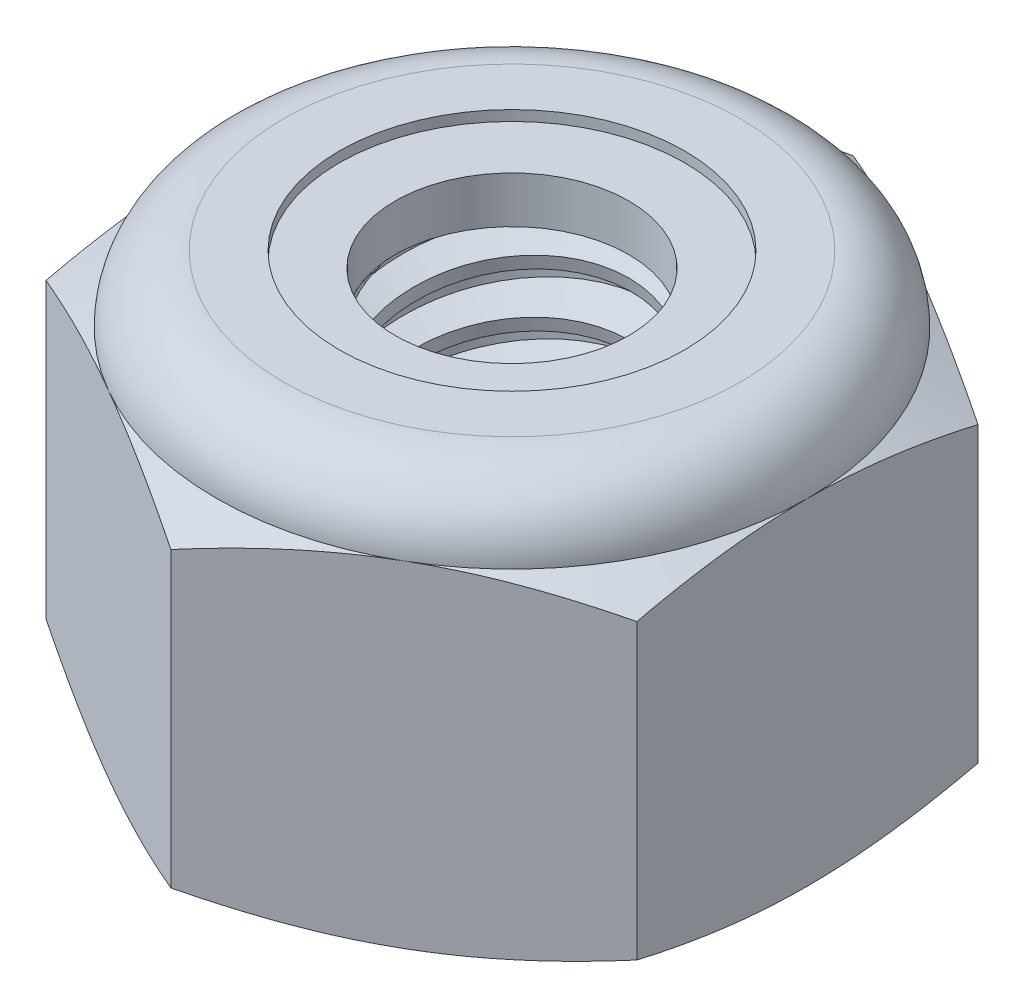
from build123d import *

# Parameters (mm, degrees)
EXTRUDE1_DEPTH      = 5.953125
SKETCH2_W           = 2.0828
SKETCH2_H           = 5.953125
LPATTERN1_COUNT     = 8
LPATTERN1_PITCH     = 0.79375
LPATTERN1_COL_COUNT = 2
LPATTERN1_COL_PITCH = 0.79375


with BuildPart() as part:
    # Sketch1 → Extrude1 (new body)
    with BuildSketch(Plane(origin=(0, 0, 0), x_dir=(1, 0, 0), z_dir=(0, 1, 0))):
        Polygon((0, 5.040989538), (-4.365625, 2.520494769), (-4.365625, -2.520494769), (0, -5.040989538), (4.365625, -2.520494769), (4.365625, 2.520494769), align=None)
    extrude(amount=EXTRUDE1_DEPTH)

    # Sketch4 → Cut-Revolve2 (revolve, cut)
    with BuildSketch(Plane(origin=(0, 0, 0), x_dir=(0, 0, -1), z_dir=(1, 0, 0)), mode=Mode.PRIVATE) as cut_revolve2_sk:
        Polygon((0, 5.953125), (2.0828, 5.953125), (1.725765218, 5.786636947), (1.725765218, 0.166488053), (2.0828, 0), (0, 0), align=None)
    revolve(cut_revolve2_sk.sketch.rotate(Axis((0, 5.953125, 0), (0, 1, 0)), 54.618153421), axis=Axis((0, 5.953125, 0), (0, 1, 0)), mode=Mode.SUBTRACT)


with BuildPart() as body_2:
    # Sketch2 → Revolve1 (revolve)
    with BuildSketch(Plane(origin=(0, 0, 0), x_dir=(0, 0, -1), z_dir=(1, 0, 0))):
        with Locations((1.0414, 2.9765625)):
            Rectangle(SKETCH2_W, SKETCH2_H)
    revolve(axis=Axis((0, -2.0828, 0), (0, 1, 0)))

    # Sketch3 → Cut-Revolve1 (revolve, cut)
    with BuildSketch(Plane(origin=(0, 0, 0), x_dir=(0, 0, -1), z_dir=(1, 0, 0)), mode=Mode.PRIVATE) as cut_revolve1_sk:
        Polygon((2.101371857, 5.855659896), (2.231374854, 5.173404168), (1.762908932, 5.33664843), (1.725765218, 5.531578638), align=None)
    cut_revolve1 = revolve(cut_revolve1_sk.sketch.rotate(Axis((0, 5.953125, 0.162231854), (0, -0.9823254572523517, -0.18718091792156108)), 180), axis=Axis((0, 5.953125, 0.162231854), (0, -0.9823254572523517, -0.18718091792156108)), mode=Mode.SUBTRACT)

    # LPattern1: Cut-Revolve1 ×8
    with Locations(*[(0, -i * LPATTERN1_PITCH, 0) for i in range(1, LPATTERN1_COUNT)]):
        add(cut_revolve1, mode=Mode.SUBTRACT)

    # LPattern1 col: Cut-Revolve1 ×2
    with Locations(*[(0, i * LPATTERN1_COL_PITCH, 0) for i in range(1, LPATTERN1_COL_COUNT)]):
        add(cut_revolve1, mode=Mode.SUBTRACT)


with BuildPart() as part_1:
    add(part.part)

    # Combine1: cut body 2
    add(body_2.part, mode=Mode.SUBTRACT)

    # Sketch5 → Cut-Revolve3 (revolve, cut)
    with BuildSketch(Plane(origin=(0, 0, 0), x_dir=(0, 0, -1), z_dir=(1, 0, 0)), mode=Mode.PRIVATE) as cut_revolve3_sk:
        with BuildLine():
            Line((0, 0), (4.365625, 0))
            Line((4.365625, 0), (5.040989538, 0.314927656))
            Line((5.040989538, 0.314927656), (5.040989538, 4.646009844))
            Line((5.040989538, 4.646009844), (4.365625, 4.9609375))
            ThreePointArc((4.365625, 4.9609375), (4.075020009, 5.662520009), (3.3734375, 5.953125))
            Line((3.3734375, 5.953125), (3.3734375, 7.223125))
            Line((3.3734375, 7.223125), (6.310989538, 7.223125))
            Line((6.310989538, 7.223125), (6.310989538, -1.27))
            Line((6.310989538, -1.27), (0, -1.27))
            Line((0, -1.27), (0, 0))
        make_face()
    revolve(cut_revolve3_sk.sketch.rotate(Axis((0, 0, 0), (0, 1, 0)), 54.618153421), axis=Axis((0, 0, 0), (0, 1, 0)), mode=Mode.SUBTRACT)

    # Sketch6 → Cut-Revolve4 (revolve, cut)
    with BuildSketch(Plane(origin=(0, 0, 0), x_dir=(0, 0, -1), z_dir=(1, 0, 0)), mode=Mode.PRIVATE) as cut_revolve4_sk:
        with BuildLine():
            Line((0, 4.9609375), (4.213225, 4.9609375))
            ThreePointArc((4.213225, 4.9609375), (3.967256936, 5.554756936), (3.3734375, 5.800725))
            Line((3.3734375, 5.800725), (2.549601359, 5.800725))
            Line((2.549601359, 5.800725), (2.549601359, 7.223125))
            Line((2.549601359, 7.223125), (0, 7.223125))
            Line((0, 7.223125), (0, 4.9609375))
        make_face()
    revolve(cut_revolve4_sk.sketch.rotate(Axis((0, 7.223125, 0), (0, 1, 0)), 54.618153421), axis=Axis((0, 7.223125, 0), (0, 1, 0)), mode=Mode.SUBTRACT)


with BuildPart() as body_2_2:
    # Sketch7 → Revolve2 (revolve)
    with BuildSketch(Plane(origin=(0, 0, 0), x_dir=(0, 0, -1), z_dir=(1, 0, 0))):
        with BuildLine():
            Line((1.725765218, 5.0371375), (4.133213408, 5.0371375))
            ThreePointArc((4.133213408, 5.0371375), (3.885726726, 5.527175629), (3.3734375, 5.724525))
            Line((3.3734375, 5.724525), (1.725765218, 5.724525))
            Line((1.725765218, 5.724525), (1.725765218, 5.0371375))
        make_face()
    revolve(axis=Axis((0, 5.0371375, 0), (0, 1, 0)))


solid = Compound([part_1.part, body_2_2.part])
